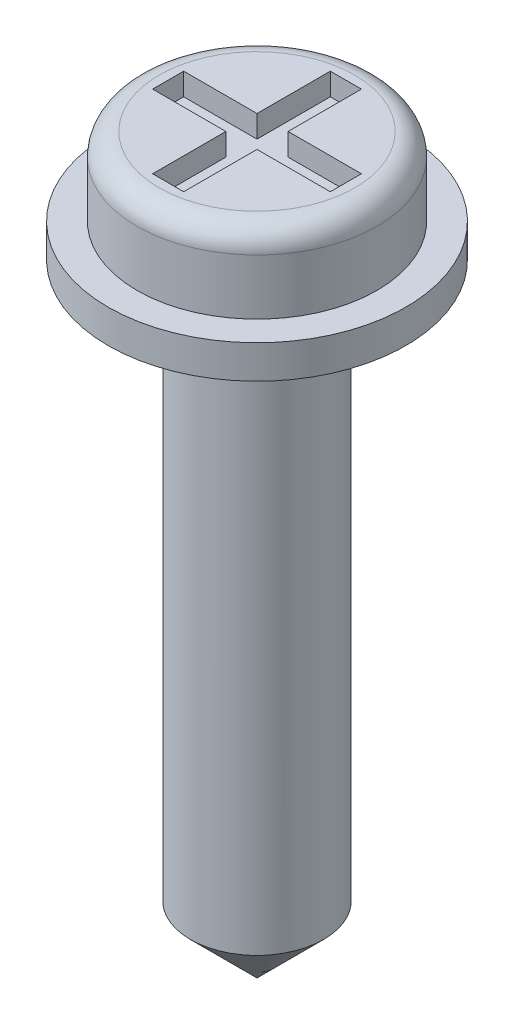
ISO-10303-21;
HEADER;
FILE_DESCRIPTION(('STEP AP214'),'2;1');
FILE_NAME('part.step','',(''),(''),'','','');
FILE_SCHEMA(('AUTOMOTIVE_DESIGN { 1 0 10303 214 1 1 1 1 }'));
ENDSEC;
DATA;
#1=APPLICATION_CONTEXT('core data for automotive mechanical design processes');
#2=APPLICATION_PROTOCOL_DEFINITION('international standard','automotive_design',2000,#1);
#3=PRODUCT_CONTEXT('',#1,'mechanical');
#4=PRODUCT('Part','Part','',(#3));
#5=PRODUCT_RELATED_PRODUCT_CATEGORY('part','',(#4));
#6=PRODUCT_DEFINITION_FORMATION('','',#4);
#7=PRODUCT_DEFINITION_CONTEXT('part definition',#1,'design');
#8=PRODUCT_DEFINITION('design','',#6,#7);
#9=PRODUCT_DEFINITION_SHAPE('','',#8);
#10=(LENGTH_UNIT() NAMED_UNIT(*) SI_UNIT(.MILLI.,.METRE.));
#11=(NAMED_UNIT(*) PLANE_ANGLE_UNIT() SI_UNIT($,.RADIAN.));
#12=(NAMED_UNIT(*) SI_UNIT($,.STERADIAN.) SOLID_ANGLE_UNIT());
#13=UNCERTAINTY_MEASURE_WITH_UNIT(LENGTH_MEASURE(1.E-05),#10,'distance_accuracy_value','');
#14=(GEOMETRIC_REPRESENTATION_CONTEXT(3) GLOBAL_UNCERTAINTY_ASSIGNED_CONTEXT((#13)) GLOBAL_UNIT_ASSIGNED_CONTEXT((#10,
#11,#12)) REPRESENTATION_CONTEXT('',''));
#15=CARTESIAN_POINT('',(0.,0.,0.));
#16=DIRECTION('',(0.,0.,1.));
#17=DIRECTION('',(1.,0.,0.));
#18=AXIS2_PLACEMENT_3D('',#15,#16,#17);
#19=CARTESIAN_POINT('',(-3.35,0.,0.));
#20=DIRECTION('',(0.,1.,0.));
#21=DIRECTION('',(0.,0.,1.));
#22=AXIS2_PLACEMENT_3D('',#19,#20,#21);
#23=PLANE('',#22);
#24=CARTESIAN_POINT('',(0.,0.,0.));
#25=DIRECTION('',(0.,-1.,0.));
#26=DIRECTION('',(0.,0.,-1.));
#27=AXIS2_PLACEMENT_3D('',#24,#25,#26);
#28=CIRCLE('',#27,1.5);
#29=CARTESIAN_POINT('',(0.,0.,-1.5));
#30=VERTEX_POINT('',#29);
#31=EDGE_CURVE('E206',#30,#30,#28,.T.);
#32=ORIENTED_EDGE('',*,*,#31,.F.);
#33=EDGE_LOOP('',(#32));
#34=FACE_BOUND('',#33,.T.);
#35=CARTESIAN_POINT('',(0.,0.,0.));
#36=DIRECTION('',(0.,-1.,0.));
#37=DIRECTION('',(0.,0.,-1.));
#38=AXIS2_PLACEMENT_3D('',#35,#36,#37);
#39=CIRCLE('',#38,3.35);
#40=CARTESIAN_POINT('',(0.,0.,-3.35));
#41=VERTEX_POINT('',#40);
#42=EDGE_CURVE('E237',#41,#41,#39,.T.);
#43=ORIENTED_EDGE('',*,*,#42,.T.);
#44=EDGE_LOOP('',(#43));
#45=FACE_BOUND('',#44,.T.);
#46=ADVANCED_FACE('F34',(#34,#45),#23,.F.);
#47=CARTESIAN_POINT('',(0.,0.,0.));
#48=DIRECTION('',(0.,-1.,0.));
#49=DIRECTION('',(0.,0.,-1.));
#50=AXIS2_PLACEMENT_3D('',#47,#48,#49);
#51=CYLINDRICAL_SURFACE('',#50,3.35);
#52=ORIENTED_EDGE('',*,*,#42,.F.);
#53=EDGE_LOOP('',(#52));
#54=FACE_BOUND('',#53,.T.);
#55=CARTESIAN_POINT('',(0.,0.75,0.));
#56=DIRECTION('',(0.,-1.,0.));
#57=DIRECTION('',(0.,0.,-1.));
#58=AXIS2_PLACEMENT_3D('',#55,#56,#57);
#59=CIRCLE('',#58,3.35);
#60=CARTESIAN_POINT('',(0.,0.75,-3.35));
#61=VERTEX_POINT('',#60);
#62=EDGE_CURVE('E234',#61,#61,#59,.T.);
#63=ORIENTED_EDGE('',*,*,#62,.T.);
#64=EDGE_LOOP('',(#63));
#65=FACE_BOUND('',#64,.T.);
#66=ADVANCED_FACE('F259',(#54,#65),#51,.T.);
#67=CARTESIAN_POINT('',(-2.7,0.75,0.));
#68=DIRECTION('',(0.,-1.,0.));
#69=DIRECTION('',(0.,0.,-1.));
#70=AXIS2_PLACEMENT_3D('',#67,#68,#69);
#71=PLANE('',#70);
#72=ORIENTED_EDGE('',*,*,#62,.F.);
#73=EDGE_LOOP('',(#72));
#74=FACE_BOUND('',#73,.T.);
#75=CARTESIAN_POINT('',(0.,0.75,0.));
#76=DIRECTION('',(0.,-1.,0.));
#77=DIRECTION('',(0.,0.,-1.));
#78=AXIS2_PLACEMENT_3D('',#75,#76,#77);
#79=CIRCLE('',#78,2.7);
#80=CARTESIAN_POINT('',(0.,0.75,-2.7));
#81=VERTEX_POINT('',#80);
#82=EDGE_CURVE('E231',#81,#81,#79,.T.);
#83=ORIENTED_EDGE('',*,*,#82,.T.);
#84=EDGE_LOOP('',(#83));
#85=FACE_BOUND('',#84,.T.);
#86=ADVANCED_FACE('F264',(#74,#85),#71,.F.);
#87=CARTESIAN_POINT('',(0.,0.,0.));
#88=DIRECTION('',(0.,-1.,0.));
#89=DIRECTION('',(0.,0.,-1.));
#90=AXIS2_PLACEMENT_3D('',#87,#88,#89);
#91=CYLINDRICAL_SURFACE('',#90,2.7);
#92=CARTESIAN_POINT('',(0.,2.,0.));
#93=DIRECTION('',(0.,-1.,0.));
#94=DIRECTION('',(0.,0.,-1.));
#95=AXIS2_PLACEMENT_3D('',#92,#93,#94);
#96=CIRCLE('',#95,2.7);
#97=CARTESIAN_POINT('',(0.,2.,-2.7));
#98=VERTEX_POINT('',#97);
#99=EDGE_CURVE('E42',#98,#98,#96,.T.);
#100=ORIENTED_EDGE('',*,*,#99,.T.);
#101=EDGE_LOOP('',(#100));
#102=FACE_BOUND('',#101,.T.);
#103=ORIENTED_EDGE('',*,*,#82,.F.);
#104=EDGE_LOOP('',(#103));
#105=FACE_BOUND('',#104,.T.);
#106=ADVANCED_FACE('F242',(#102,#105),#91,.T.);
#107=CARTESIAN_POINT('',(0.,2.5,0.));
#108=DIRECTION('',(0.,-1.,0.));
#109=DIRECTION('',(0.,0.,-1.));
#110=AXIS2_PLACEMENT_3D('',#107,#108,#109);
#111=PLANE('',#110);
#112=DIRECTION('',(1.,0.,0.));
#113=VECTOR('',#112,1.);
#114=CARTESIAN_POINT('',(-0.35,2.5,0.35));
#115=LINE('',#114,#113);
#116=CARTESIAN_POINT('',(-2.,2.5,0.35));
#117=VERTEX_POINT('',#116);
#118=CARTESIAN_POINT('',(-0.35,2.5,0.35));
#119=VERTEX_POINT('',#118);
#120=EDGE_CURVE('E176',#117,#119,#115,.T.);
#121=ORIENTED_EDGE('',*,*,#120,.F.);
#122=DIRECTION('',(0.,0.,1.));
#123=VECTOR('',#122,1.);
#124=CARTESIAN_POINT('',(-2.,2.5,0.35));
#125=LINE('',#124,#123);
#126=CARTESIAN_POINT('',(-2.,2.5,-0.35));
#127=VERTEX_POINT('',#126);
#128=EDGE_CURVE('E49',#127,#117,#125,.T.);
#129=ORIENTED_EDGE('',*,*,#128,.F.);
#130=DIRECTION('',(-1.,0.,0.));
#131=VECTOR('',#130,1.);
#132=CARTESIAN_POINT('',(-2.,2.5,-0.35));
#133=LINE('',#132,#131);
#134=CARTESIAN_POINT('',(-0.35,2.5,-0.35));
#135=VERTEX_POINT('',#134);
#136=EDGE_CURVE('E144',#135,#127,#133,.T.);
#137=ORIENTED_EDGE('',*,*,#136,.F.);
#138=DIRECTION('',(0.,0.,1.));
#139=VECTOR('',#138,1.);
#140=CARTESIAN_POINT('',(-0.35,2.5,-0.35));
#141=LINE('',#140,#139);
#142=CARTESIAN_POINT('',(-0.35,2.5,-2.));
#143=VERTEX_POINT('',#142);
#144=EDGE_CURVE('E147',#143,#135,#141,.T.);
#145=ORIENTED_EDGE('',*,*,#144,.F.);
#146=DIRECTION('',(-1.,0.,0.));
#147=VECTOR('',#146,1.);
#148=CARTESIAN_POINT('',(-0.35,2.5,-2.));
#149=LINE('',#148,#147);
#150=CARTESIAN_POINT('',(0.35,2.5,-2.));
#151=VERTEX_POINT('',#150);
#152=EDGE_CURVE('E199',#151,#143,#149,.T.);
#153=ORIENTED_EDGE('',*,*,#152,.F.);
#154=DIRECTION('',(0.,0.,-1.));
#155=VECTOR('',#154,1.);
#156=CARTESIAN_POINT('',(0.35,2.5,-2.));
#157=LINE('',#156,#155);
#158=CARTESIAN_POINT('',(0.35,2.5,-0.35));
#159=VERTEX_POINT('',#158);
#160=EDGE_CURVE('E196',#159,#151,#157,.T.);
#161=ORIENTED_EDGE('',*,*,#160,.F.);
#162=DIRECTION('',(-1.,0.,0.));
#163=VECTOR('',#162,1.);
#164=CARTESIAN_POINT('',(0.35,2.5,-0.35));
#165=LINE('',#164,#163);
#166=CARTESIAN_POINT('',(2.,2.5,-0.35));
#167=VERTEX_POINT('',#166);
#168=EDGE_CURVE('E193',#167,#159,#165,.T.);
#169=ORIENTED_EDGE('',*,*,#168,.F.);
#170=DIRECTION('',(0.,0.,-1.));
#171=VECTOR('',#170,1.);
#172=CARTESIAN_POINT('',(2.,2.5,-0.35));
#173=LINE('',#172,#171);
#174=CARTESIAN_POINT('',(2.,2.5,0.35));
#175=VERTEX_POINT('',#174);
#176=EDGE_CURVE('E190',#175,#167,#173,.T.);
#177=ORIENTED_EDGE('',*,*,#176,.F.);
#178=DIRECTION('',(1.,0.,0.));
#179=VECTOR('',#178,1.);
#180=CARTESIAN_POINT('',(2.,2.5,0.35));
#181=LINE('',#180,#179);
#182=CARTESIAN_POINT('',(0.35,2.5,0.35));
#183=VERTEX_POINT('',#182);
#184=EDGE_CURVE('E187',#183,#175,#181,.T.);
#185=ORIENTED_EDGE('',*,*,#184,.F.);
#186=DIRECTION('',(0.,0.,-1.));
#187=VECTOR('',#186,1.);
#188=CARTESIAN_POINT('',(0.35,2.5,0.35));
#189=LINE('',#188,#187);
#190=CARTESIAN_POINT('',(0.35,2.5,2.));
#191=VERTEX_POINT('',#190);
#192=EDGE_CURVE('E184',#191,#183,#189,.T.);
#193=ORIENTED_EDGE('',*,*,#192,.F.);
#194=DIRECTION('',(1.,0.,0.));
#195=VECTOR('',#194,1.);
#196=CARTESIAN_POINT('',(0.35,2.5,2.));
#197=LINE('',#196,#195);
#198=CARTESIAN_POINT('',(-0.35,2.5,2.));
#199=VERTEX_POINT('',#198);
#200=EDGE_CURVE('E181',#199,#191,#197,.T.);
#201=ORIENTED_EDGE('',*,*,#200,.F.);
#202=DIRECTION('',(0.,0.,1.));
#203=VECTOR('',#202,1.);
#204=CARTESIAN_POINT('',(-0.35,2.5,2.));
#205=LINE('',#204,#203);
#206=EDGE_CURVE('E178',#119,#199,#205,.T.);
#207=ORIENTED_EDGE('',*,*,#206,.F.);
#208=EDGE_LOOP('',(#121,#129,#137,#145,#153,#161,#169,#177,#185,#193,#201,#207));
#209=FACE_BOUND('',#208,.T.);
#210=CARTESIAN_POINT('',(0.,2.5,0.));
#211=DIRECTION('',(0.,-1.,0.));
#212=DIRECTION('',(0.,0.,-1.));
#213=AXIS2_PLACEMENT_3D('',#210,#211,#212);
#214=CIRCLE('',#213,2.2);
#215=CARTESIAN_POINT('',(0.,2.5,-2.2));
#216=VERTEX_POINT('',#215);
#217=EDGE_CURVE('E11',#216,#216,#214,.F.);
#218=ORIENTED_EDGE('',*,*,#217,.T.);
#219=EDGE_LOOP('',(#218));
#220=FACE_BOUND('',#219,.T.);
#221=ADVANCED_FACE('F275',(#209,#220),#111,.F.);
#222=CARTESIAN_POINT('',(0.,-12.5,0.));
#223=DIRECTION('',(0.,1.,0.));
#224=DIRECTION('',(0.,0.,1.));
#225=AXIS2_PLACEMENT_3D('',#222,#223,#224);
#226=CONICAL_SURFACE('',#225,1.5,0.785398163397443);
#227=CARTESIAN_POINT('',(0.,-14.,0.));
#228=VERTEX_POINT('',#227);
#229=VERTEX_LOOP('',#228);
#230=FACE_BOUND('',#229,.T.);
#231=CARTESIAN_POINT('',(0.,-12.5,0.));
#232=DIRECTION('',(0.,-1.,0.));
#233=DIRECTION('',(0.,0.,-1.));
#234=AXIS2_PLACEMENT_3D('',#231,#232,#233);
#235=CIRCLE('',#234,1.5);
#236=CARTESIAN_POINT('',(0.,-12.5,-1.5));
#237=VERTEX_POINT('',#236);
#238=EDGE_CURVE('E228',#237,#237,#235,.T.);
#239=ORIENTED_EDGE('',*,*,#238,.T.);
#240=EDGE_LOOP('',(#239));
#241=FACE_BOUND('',#240,.T.);
#242=ADVANCED_FACE('F254',(#230,#241),#226,.T.);
#243=CARTESIAN_POINT('',(0.,0.,0.));
#244=DIRECTION('',(0.,-1.,0.));
#245=DIRECTION('',(0.,0.,-1.));
#246=AXIS2_PLACEMENT_3D('',#243,#244,#245);
#247=CYLINDRICAL_SURFACE('',#246,1.5);
#248=ORIENTED_EDGE('',*,*,#238,.F.);
#249=EDGE_LOOP('',(#248));
#250=FACE_BOUND('',#249,.T.);
#251=ORIENTED_EDGE('',*,*,#31,.T.);
#252=EDGE_LOOP('',(#251));
#253=FACE_BOUND('',#252,.T.);
#254=ADVANCED_FACE('F246',(#250,#253),#247,.T.);
#255=CARTESIAN_POINT('',(0.,2.,0.));
#256=DIRECTION('',(0.,-1.,0.));
#257=DIRECTION('',(0.,0.,-1.));
#258=AXIS2_PLACEMENT_3D('',#255,#256,#257);
#259=TOROIDAL_SURFACE('',#258,2.2,0.5);
#260=ORIENTED_EDGE('',*,*,#217,.F.);
#261=EDGE_LOOP('',(#260));
#262=FACE_BOUND('',#261,.T.);
#263=ORIENTED_EDGE('',*,*,#99,.F.);
#264=EDGE_LOOP('',(#263));
#265=FACE_BOUND('',#264,.T.);
#266=ADVANCED_FACE('F36',(#262,#265),#259,.T.);
#267=CARTESIAN_POINT('',(-2.,2.,0.35));
#268=DIRECTION('',(-1.,0.,0.));
#269=DIRECTION('',(0.,0.,1.));
#270=AXIS2_PLACEMENT_3D('',#267,#268,#269);
#271=PLANE('',#270);
#272=ORIENTED_EDGE('',*,*,#128,.T.);
#273=DIRECTION('',(0.,1.,0.));
#274=VECTOR('',#273,1.);
#275=CARTESIAN_POINT('',(-2.,2.,0.35));
#276=LINE('',#275,#274);
#277=CARTESIAN_POINT('',(-2.,2.,0.35));
#278=VERTEX_POINT('',#277);
#279=EDGE_CURVE('E121',#278,#117,#276,.T.);
#280=ORIENTED_EDGE('',*,*,#279,.F.);
#281=DIRECTION('',(0.,0.,1.));
#282=VECTOR('',#281,1.);
#283=CARTESIAN_POINT('',(-2.,2.,0.35));
#284=LINE('',#283,#282);
#285=CARTESIAN_POINT('',(-2.,2.,-0.35));
#286=VERTEX_POINT('',#285);
#287=EDGE_CURVE('E125',#286,#278,#284,.T.);
#288=ORIENTED_EDGE('',*,*,#287,.F.);
#289=DIRECTION('',(0.,1.,0.));
#290=VECTOR('',#289,1.);
#291=CARTESIAN_POINT('',(-2.,2.,-0.35));
#292=LINE('',#291,#290);
#293=EDGE_CURVE('E204',#286,#127,#292,.T.);
#294=ORIENTED_EDGE('',*,*,#293,.T.);
#295=EDGE_LOOP('',(#272,#280,#288,#294));
#296=FACE_BOUND('',#295,.T.);
#297=ADVANCED_FACE('F123',(#296),#271,.F.);
#298=CARTESIAN_POINT('',(-2.,2.,-0.35));
#299=DIRECTION('',(0.,0.,-1.));
#300=DIRECTION('',(-1.,0.,0.));
#301=AXIS2_PLACEMENT_3D('',#298,#299,#300);
#302=PLANE('',#301);
#303=ORIENTED_EDGE('',*,*,#136,.T.);
#304=ORIENTED_EDGE('',*,*,#293,.F.);
#305=DIRECTION('',(-1.,0.,0.));
#306=VECTOR('',#305,1.);
#307=CARTESIAN_POINT('',(-2.,2.,-0.35));
#308=LINE('',#307,#306);
#309=CARTESIAN_POINT('',(-0.35,2.,-0.35));
#310=VERTEX_POINT('',#309);
#311=EDGE_CURVE('E131',#310,#286,#308,.T.);
#312=ORIENTED_EDGE('',*,*,#311,.F.);
#313=DIRECTION('',(0.,1.,0.));
#314=VECTOR('',#313,1.);
#315=CARTESIAN_POINT('',(-0.35,2.,-0.35));
#316=LINE('',#315,#314);
#317=EDGE_CURVE('E207',#310,#135,#316,.T.);
#318=ORIENTED_EDGE('',*,*,#317,.T.);
#319=EDGE_LOOP('',(#303,#304,#312,#318));
#320=FACE_BOUND('',#319,.T.);
#321=ADVANCED_FACE('F252',(#320),#302,.F.);
#322=CARTESIAN_POINT('',(-0.35,2.,-0.35));
#323=DIRECTION('',(-1.,0.,0.));
#324=DIRECTION('',(0.,0.,1.));
#325=AXIS2_PLACEMENT_3D('',#322,#323,#324);
#326=PLANE('',#325);
#327=ORIENTED_EDGE('',*,*,#144,.T.);
#328=ORIENTED_EDGE('',*,*,#317,.F.);
#329=DIRECTION('',(0.,0.,1.));
#330=VECTOR('',#329,1.);
#331=CARTESIAN_POINT('',(-0.35,2.,-0.35));
#332=LINE('',#331,#330);
#333=CARTESIAN_POINT('',(-0.35,2.,-2.));
#334=VERTEX_POINT('',#333);
#335=EDGE_CURVE('E172',#334,#310,#332,.T.);
#336=ORIENTED_EDGE('',*,*,#335,.F.);
#337=DIRECTION('',(0.,1.,0.));
#338=VECTOR('',#337,1.);
#339=CARTESIAN_POINT('',(-0.35,2.,-2.));
#340=LINE('',#339,#338);
#341=EDGE_CURVE('E209',#334,#143,#340,.T.);
#342=ORIENTED_EDGE('',*,*,#341,.T.);
#343=EDGE_LOOP('',(#327,#328,#336,#342));
#344=FACE_BOUND('',#343,.T.);
#345=ADVANCED_FACE('F314',(#344),#326,.F.);
#346=CARTESIAN_POINT('',(-0.35,2.,-2.));
#347=DIRECTION('',(0.,0.,-1.));
#348=DIRECTION('',(-1.,0.,0.));
#349=AXIS2_PLACEMENT_3D('',#346,#347,#348);
#350=PLANE('',#349);
#351=ORIENTED_EDGE('',*,*,#152,.T.);
#352=ORIENTED_EDGE('',*,*,#341,.F.);
#353=DIRECTION('',(-1.,0.,0.));
#354=VECTOR('',#353,1.);
#355=CARTESIAN_POINT('',(-0.35,2.,-2.));
#356=LINE('',#355,#354);
#357=CARTESIAN_POINT('',(0.35,2.,-2.));
#358=VERTEX_POINT('',#357);
#359=EDGE_CURVE('E169',#358,#334,#356,.T.);
#360=ORIENTED_EDGE('',*,*,#359,.F.);
#361=DIRECTION('',(0.,1.,0.));
#362=VECTOR('',#361,1.);
#363=CARTESIAN_POINT('',(0.35,2.,-2.));
#364=LINE('',#363,#362);
#365=EDGE_CURVE('E211',#358,#151,#364,.T.);
#366=ORIENTED_EDGE('',*,*,#365,.T.);
#367=EDGE_LOOP('',(#351,#352,#360,#366));
#368=FACE_BOUND('',#367,.T.);
#369=ADVANCED_FACE('F310',(#368),#350,.F.);
#370=CARTESIAN_POINT('',(0.35,2.,-2.));
#371=DIRECTION('',(1.,0.,0.));
#372=DIRECTION('',(0.,0.,-1.));
#373=AXIS2_PLACEMENT_3D('',#370,#371,#372);
#374=PLANE('',#373);
#375=ORIENTED_EDGE('',*,*,#160,.T.);
#376=ORIENTED_EDGE('',*,*,#365,.F.);
#377=DIRECTION('',(0.,0.,-1.));
#378=VECTOR('',#377,1.);
#379=CARTESIAN_POINT('',(0.35,2.,-2.));
#380=LINE('',#379,#378);
#381=CARTESIAN_POINT('',(0.35,2.,-0.35));
#382=VERTEX_POINT('',#381);
#383=EDGE_CURVE('E166',#382,#358,#380,.T.);
#384=ORIENTED_EDGE('',*,*,#383,.F.);
#385=DIRECTION('',(0.,1.,0.));
#386=VECTOR('',#385,1.);
#387=CARTESIAN_POINT('',(0.35,2.,-0.35));
#388=LINE('',#387,#386);
#389=EDGE_CURVE('E213',#382,#159,#388,.T.);
#390=ORIENTED_EDGE('',*,*,#389,.T.);
#391=EDGE_LOOP('',(#375,#376,#384,#390));
#392=FACE_BOUND('',#391,.T.);
#393=ADVANCED_FACE('F306',(#392),#374,.F.);
#394=CARTESIAN_POINT('',(0.35,2.,-0.35));
#395=DIRECTION('',(0.,0.,-1.));
#396=DIRECTION('',(-1.,0.,0.));
#397=AXIS2_PLACEMENT_3D('',#394,#395,#396);
#398=PLANE('',#397);
#399=ORIENTED_EDGE('',*,*,#168,.T.);
#400=ORIENTED_EDGE('',*,*,#389,.F.);
#401=DIRECTION('',(-1.,0.,0.));
#402=VECTOR('',#401,1.);
#403=CARTESIAN_POINT('',(0.35,2.,-0.35));
#404=LINE('',#403,#402);
#405=CARTESIAN_POINT('',(2.,2.,-0.35));
#406=VERTEX_POINT('',#405);
#407=EDGE_CURVE('E163',#406,#382,#404,.T.);
#408=ORIENTED_EDGE('',*,*,#407,.F.);
#409=DIRECTION('',(0.,1.,0.));
#410=VECTOR('',#409,1.);
#411=CARTESIAN_POINT('',(2.,2.,-0.35));
#412=LINE('',#411,#410);
#413=EDGE_CURVE('E215',#406,#167,#412,.T.);
#414=ORIENTED_EDGE('',*,*,#413,.T.);
#415=EDGE_LOOP('',(#399,#400,#408,#414));
#416=FACE_BOUND('',#415,.T.);
#417=ADVANCED_FACE('F302',(#416),#398,.F.);
#418=CARTESIAN_POINT('',(2.,2.,-0.35));
#419=DIRECTION('',(1.,0.,0.));
#420=DIRECTION('',(0.,0.,-1.));
#421=AXIS2_PLACEMENT_3D('',#418,#419,#420);
#422=PLANE('',#421);
#423=ORIENTED_EDGE('',*,*,#176,.T.);
#424=ORIENTED_EDGE('',*,*,#413,.F.);
#425=DIRECTION('',(0.,0.,-1.));
#426=VECTOR('',#425,1.);
#427=CARTESIAN_POINT('',(2.,2.,-0.35));
#428=LINE('',#427,#426);
#429=CARTESIAN_POINT('',(2.,2.,0.35));
#430=VERTEX_POINT('',#429);
#431=EDGE_CURVE('E160',#430,#406,#428,.T.);
#432=ORIENTED_EDGE('',*,*,#431,.F.);
#433=DIRECTION('',(0.,1.,0.));
#434=VECTOR('',#433,1.);
#435=CARTESIAN_POINT('',(2.,2.,0.35));
#436=LINE('',#435,#434);
#437=EDGE_CURVE('E217',#430,#175,#436,.T.);
#438=ORIENTED_EDGE('',*,*,#437,.T.);
#439=EDGE_LOOP('',(#423,#424,#432,#438));
#440=FACE_BOUND('',#439,.T.);
#441=ADVANCED_FACE('F298',(#440),#422,.F.);
#442=CARTESIAN_POINT('',(2.,2.,0.35));
#443=DIRECTION('',(0.,0.,1.));
#444=DIRECTION('',(1.,0.,0.));
#445=AXIS2_PLACEMENT_3D('',#442,#443,#444);
#446=PLANE('',#445);
#447=ORIENTED_EDGE('',*,*,#184,.T.);
#448=ORIENTED_EDGE('',*,*,#437,.F.);
#449=DIRECTION('',(1.,0.,0.));
#450=VECTOR('',#449,1.);
#451=CARTESIAN_POINT('',(2.,2.,0.35));
#452=LINE('',#451,#450);
#453=CARTESIAN_POINT('',(0.35,2.,0.35));
#454=VERTEX_POINT('',#453);
#455=EDGE_CURVE('E157',#454,#430,#452,.T.);
#456=ORIENTED_EDGE('',*,*,#455,.F.);
#457=DIRECTION('',(0.,1.,0.));
#458=VECTOR('',#457,1.);
#459=CARTESIAN_POINT('',(0.35,2.,0.35));
#460=LINE('',#459,#458);
#461=EDGE_CURVE('E219',#454,#183,#460,.T.);
#462=ORIENTED_EDGE('',*,*,#461,.T.);
#463=EDGE_LOOP('',(#447,#448,#456,#462));
#464=FACE_BOUND('',#463,.T.);
#465=ADVANCED_FACE('F294',(#464),#446,.F.);
#466=CARTESIAN_POINT('',(0.35,2.,0.35));
#467=DIRECTION('',(1.,0.,0.));
#468=DIRECTION('',(0.,0.,-1.));
#469=AXIS2_PLACEMENT_3D('',#466,#467,#468);
#470=PLANE('',#469);
#471=ORIENTED_EDGE('',*,*,#192,.T.);
#472=ORIENTED_EDGE('',*,*,#461,.F.);
#473=DIRECTION('',(0.,0.,-1.));
#474=VECTOR('',#473,1.);
#475=CARTESIAN_POINT('',(0.35,2.,0.35));
#476=LINE('',#475,#474);
#477=CARTESIAN_POINT('',(0.35,2.,2.));
#478=VERTEX_POINT('',#477);
#479=EDGE_CURVE('E154',#478,#454,#476,.T.);
#480=ORIENTED_EDGE('',*,*,#479,.F.);
#481=DIRECTION('',(0.,1.,0.));
#482=VECTOR('',#481,1.);
#483=CARTESIAN_POINT('',(0.35,2.,2.));
#484=LINE('',#483,#482);
#485=EDGE_CURVE('E221',#478,#191,#484,.T.);
#486=ORIENTED_EDGE('',*,*,#485,.T.);
#487=EDGE_LOOP('',(#471,#472,#480,#486));
#488=FACE_BOUND('',#487,.T.);
#489=ADVANCED_FACE('F290',(#488),#470,.F.);
#490=CARTESIAN_POINT('',(0.35,2.,2.));
#491=DIRECTION('',(0.,0.,1.));
#492=DIRECTION('',(1.,0.,0.));
#493=AXIS2_PLACEMENT_3D('',#490,#491,#492);
#494=PLANE('',#493);
#495=ORIENTED_EDGE('',*,*,#200,.T.);
#496=ORIENTED_EDGE('',*,*,#485,.F.);
#497=DIRECTION('',(1.,0.,0.));
#498=VECTOR('',#497,1.);
#499=CARTESIAN_POINT('',(0.35,2.,2.));
#500=LINE('',#499,#498);
#501=CARTESIAN_POINT('',(-0.35,2.,2.));
#502=VERTEX_POINT('',#501);
#503=EDGE_CURVE('E151',#502,#478,#500,.T.);
#504=ORIENTED_EDGE('',*,*,#503,.F.);
#505=DIRECTION('',(0.,1.,0.));
#506=VECTOR('',#505,1.);
#507=CARTESIAN_POINT('',(-0.35,2.,2.));
#508=LINE('',#507,#506);
#509=EDGE_CURVE('E223',#502,#199,#508,.T.);
#510=ORIENTED_EDGE('',*,*,#509,.T.);
#511=EDGE_LOOP('',(#495,#496,#504,#510));
#512=FACE_BOUND('',#511,.T.);
#513=ADVANCED_FACE('F286',(#512),#494,.F.);
#514=CARTESIAN_POINT('',(-0.35,2.,2.));
#515=DIRECTION('',(-1.,0.,0.));
#516=DIRECTION('',(0.,0.,1.));
#517=AXIS2_PLACEMENT_3D('',#514,#515,#516);
#518=PLANE('',#517);
#519=ORIENTED_EDGE('',*,*,#206,.T.);
#520=ORIENTED_EDGE('',*,*,#509,.F.);
#521=DIRECTION('',(0.,0.,1.));
#522=VECTOR('',#521,1.);
#523=CARTESIAN_POINT('',(-0.35,2.,2.));
#524=LINE('',#523,#522);
#525=CARTESIAN_POINT('',(-0.35,2.,0.35));
#526=VERTEX_POINT('',#525);
#527=EDGE_CURVE('E139',#526,#502,#524,.T.);
#528=ORIENTED_EDGE('',*,*,#527,.F.);
#529=DIRECTION('',(0.,1.,0.));
#530=VECTOR('',#529,1.);
#531=CARTESIAN_POINT('',(-0.35,2.,0.35));
#532=LINE('',#531,#530);
#533=EDGE_CURVE('E130',#526,#119,#532,.T.);
#534=ORIENTED_EDGE('',*,*,#533,.T.);
#535=EDGE_LOOP('',(#519,#520,#528,#534));
#536=FACE_BOUND('',#535,.T.);
#537=ADVANCED_FACE('F283',(#536),#518,.F.);
#538=CARTESIAN_POINT('',(-0.35,2.,0.35));
#539=DIRECTION('',(0.,0.,1.));
#540=DIRECTION('',(1.,0.,0.));
#541=AXIS2_PLACEMENT_3D('',#538,#539,#540);
#542=PLANE('',#541);
#543=ORIENTED_EDGE('',*,*,#120,.T.);
#544=ORIENTED_EDGE('',*,*,#533,.F.);
#545=DIRECTION('',(1.,0.,0.));
#546=VECTOR('',#545,1.);
#547=CARTESIAN_POINT('',(-0.35,2.,0.35));
#548=LINE('',#547,#546);
#549=EDGE_CURVE('E134',#278,#526,#548,.T.);
#550=ORIENTED_EDGE('',*,*,#549,.F.);
#551=ORIENTED_EDGE('',*,*,#279,.T.);
#552=EDGE_LOOP('',(#543,#544,#550,#551));
#553=FACE_BOUND('',#552,.T.);
#554=ADVANCED_FACE('F135',(#553),#542,.F.);
#555=CARTESIAN_POINT('',(0.,2.,0.));
#556=DIRECTION('',(0.,-1.,0.));
#557=DIRECTION('',(0.,0.,-1.));
#558=AXIS2_PLACEMENT_3D('',#555,#556,#557);
#559=PLANE('',#558);
#560=ORIENTED_EDGE('',*,*,#287,.T.);
#561=ORIENTED_EDGE('',*,*,#549,.T.);
#562=ORIENTED_EDGE('',*,*,#527,.T.);
#563=ORIENTED_EDGE('',*,*,#503,.T.);
#564=ORIENTED_EDGE('',*,*,#479,.T.);
#565=ORIENTED_EDGE('',*,*,#455,.T.);
#566=ORIENTED_EDGE('',*,*,#431,.T.);
#567=ORIENTED_EDGE('',*,*,#407,.T.);
#568=ORIENTED_EDGE('',*,*,#383,.T.);
#569=ORIENTED_EDGE('',*,*,#359,.T.);
#570=ORIENTED_EDGE('',*,*,#335,.T.);
#571=ORIENTED_EDGE('',*,*,#311,.T.);
#572=EDGE_LOOP('',(#560,#561,#562,#563,#564,#565,#566,#567,#568,#569,#570,#571));
#573=FACE_BOUND('',#572,.T.);
#574=ADVANCED_FACE('F141',(#573),#559,.F.);
#575=CLOSED_SHELL('',(#46,#66,#86,#106,#221,#242,#254,#266,#297,#321,#345,#369,#393,#417,#441,
#465,#489,#513,#537,#554,#574));
#576=MANIFOLD_SOLID_BREP('B2',#575);
#577=ADVANCED_BREP_SHAPE_REPRESENTATION('',(#18,#576),#14);
#578=SHAPE_DEFINITION_REPRESENTATION(#9,#577);
ENDSEC;
END-ISO-10303-21;
